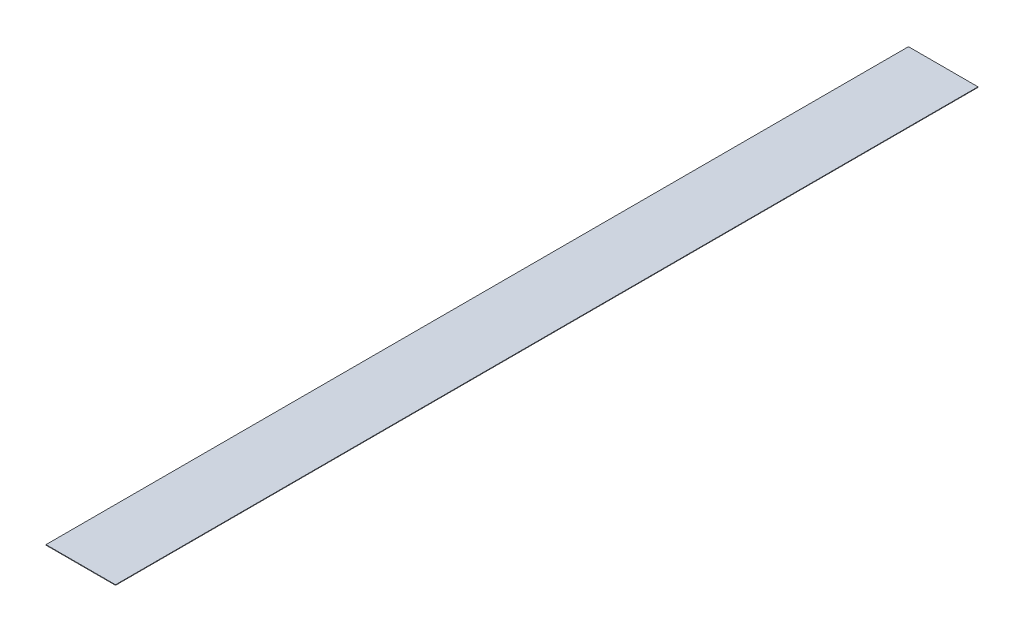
ISO-10303-21;
HEADER;
FILE_DESCRIPTION(('STEP AP214'),'2;1');
FILE_NAME('part.step','',(''),(''),'','','');
FILE_SCHEMA(('AUTOMOTIVE_DESIGN { 1 0 10303 214 1 1 1 1 }'));
ENDSEC;
DATA;
#1=APPLICATION_CONTEXT('core data for automotive mechanical design processes');
#2=APPLICATION_PROTOCOL_DEFINITION('international standard','automotive_design',2000,#1);
#3=PRODUCT_CONTEXT('',#1,'mechanical');
#4=PRODUCT('Part','Part','',(#3));
#5=PRODUCT_RELATED_PRODUCT_CATEGORY('part','',(#4));
#6=PRODUCT_DEFINITION_FORMATION('','',#4);
#7=PRODUCT_DEFINITION_CONTEXT('part definition',#1,'design');
#8=PRODUCT_DEFINITION('design','',#6,#7);
#9=PRODUCT_DEFINITION_SHAPE('','',#8);
#10=(LENGTH_UNIT() NAMED_UNIT(*) SI_UNIT(.MILLI.,.METRE.));
#11=(NAMED_UNIT(*) PLANE_ANGLE_UNIT() SI_UNIT($,.RADIAN.));
#12=(NAMED_UNIT(*) SI_UNIT($,.STERADIAN.) SOLID_ANGLE_UNIT());
#13=UNCERTAINTY_MEASURE_WITH_UNIT(LENGTH_MEASURE(1.E-05),#10,'distance_accuracy_value','');
#14=(GEOMETRIC_REPRESENTATION_CONTEXT(3) GLOBAL_UNCERTAINTY_ASSIGNED_CONTEXT((#13)) GLOBAL_UNIT_ASSIGNED_CONTEXT((#10,
#11,#12)) REPRESENTATION_CONTEXT('',''));
#15=CARTESIAN_POINT('',(0.,0.,0.));
#16=DIRECTION('',(0.,0.,1.));
#17=DIRECTION('',(1.,0.,0.));
#18=AXIS2_PLACEMENT_3D('',#15,#16,#17);
#19=CARTESIAN_POINT('',(-12.0527,0.175,-149.5));
#20=DIRECTION('',(1.,0.,0.));
#21=DIRECTION('',(0.,0.,-1.));
#22=AXIS2_PLACEMENT_3D('',#19,#20,#21);
#23=PLANE('',#22);
#24=DIRECTION('',(0.,0.,1.));
#25=VECTOR('',#24,1.);
#26=CARTESIAN_POINT('',(-12.0527,0.,-149.5));
#27=LINE('',#26,#25);
#28=CARTESIAN_POINT('',(-12.0527,0.,-149.5));
#29=VERTEX_POINT('',#28);
#30=CARTESIAN_POINT('',(-12.0527,0.,149.5));
#31=VERTEX_POINT('',#30);
#32=EDGE_CURVE('E98',#29,#31,#27,.T.);
#33=ORIENTED_EDGE('',*,*,#32,.T.);
#34=DIRECTION('',(0.,-1.,0.));
#35=VECTOR('',#34,1.);
#36=CARTESIAN_POINT('',(-12.0527,0.175,149.5));
#37=LINE('',#36,#35);
#38=CARTESIAN_POINT('',(-12.0527,0.175,149.5));
#39=VERTEX_POINT('',#38);
#40=EDGE_CURVE('E11',#39,#31,#37,.T.);
#41=ORIENTED_EDGE('',*,*,#40,.F.);
#42=DIRECTION('',(0.,0.,1.));
#43=VECTOR('',#42,1.);
#44=CARTESIAN_POINT('',(-12.0527,0.175,-149.5));
#45=LINE('',#44,#43);
#46=CARTESIAN_POINT('',(-12.0527,0.175,-149.5));
#47=VERTEX_POINT('',#46);
#48=EDGE_CURVE('E86',#47,#39,#45,.T.);
#49=ORIENTED_EDGE('',*,*,#48,.F.);
#50=DIRECTION('',(0.,-1.,0.));
#51=VECTOR('',#50,1.);
#52=CARTESIAN_POINT('',(-12.0527,0.175,-149.5));
#53=LINE('',#52,#51);
#54=EDGE_CURVE('E94',#47,#29,#53,.T.);
#55=ORIENTED_EDGE('',*,*,#54,.T.);
#56=EDGE_LOOP('',(#33,#41,#49,#55));
#57=FACE_BOUND('',#56,.T.);
#58=ADVANCED_FACE('F35',(#57),#23,.F.);
#59=CARTESIAN_POINT('',(-12.0527,0.175,149.5));
#60=DIRECTION('',(0.,0.,-1.));
#61=DIRECTION('',(-1.,0.,0.));
#62=AXIS2_PLACEMENT_3D('',#59,#60,#61);
#63=PLANE('',#62);
#64=DIRECTION('',(1.,0.,0.));
#65=VECTOR('',#64,1.);
#66=CARTESIAN_POINT('',(-12.0527,0.,149.5));
#67=LINE('',#66,#65);
#68=CARTESIAN_POINT('',(12.0527,0.,149.5));
#69=VERTEX_POINT('',#68);
#70=EDGE_CURVE('E90',#31,#69,#67,.T.);
#71=ORIENTED_EDGE('',*,*,#70,.T.);
#72=DIRECTION('',(0.,-1.,0.));
#73=VECTOR('',#72,1.);
#74=CARTESIAN_POINT('',(12.0527,0.175,149.5));
#75=LINE('',#74,#73);
#76=CARTESIAN_POINT('',(12.0527,0.175,149.5));
#77=VERTEX_POINT('',#76);
#78=EDGE_CURVE('E43',#77,#69,#75,.T.);
#79=ORIENTED_EDGE('',*,*,#78,.F.);
#80=DIRECTION('',(1.,0.,0.));
#81=VECTOR('',#80,1.);
#82=CARTESIAN_POINT('',(-12.0527,0.175,149.5));
#83=LINE('',#82,#81);
#84=EDGE_CURVE('E81',#39,#77,#83,.T.);
#85=ORIENTED_EDGE('',*,*,#84,.F.);
#86=ORIENTED_EDGE('',*,*,#40,.T.);
#87=EDGE_LOOP('',(#71,#79,#85,#86));
#88=FACE_BOUND('',#87,.T.);
#89=ADVANCED_FACE('F89',(#88),#63,.F.);
#90=CARTESIAN_POINT('',(12.0527,0.175,-149.5));
#91=DIRECTION('',(-1.,0.,0.));
#92=DIRECTION('',(0.,0.,1.));
#93=AXIS2_PLACEMENT_3D('',#90,#91,#92);
#94=PLANE('',#93);
#95=DIRECTION('',(0.,0.,-1.));
#96=VECTOR('',#95,1.);
#97=CARTESIAN_POINT('',(12.0527,0.,-149.5));
#98=LINE('',#97,#96);
#99=CARTESIAN_POINT('',(12.0527,0.,-149.5));
#100=VERTEX_POINT('',#99);
#101=EDGE_CURVE('E68',#69,#100,#98,.T.);
#102=ORIENTED_EDGE('',*,*,#101,.T.);
#103=DIRECTION('',(0.,-1.,0.));
#104=VECTOR('',#103,1.);
#105=CARTESIAN_POINT('',(12.0527,0.175,-149.5));
#106=LINE('',#105,#104);
#107=CARTESIAN_POINT('',(12.0527,0.175,-149.5));
#108=VERTEX_POINT('',#107);
#109=EDGE_CURVE('E91',#108,#100,#106,.T.);
#110=ORIENTED_EDGE('',*,*,#109,.F.);
#111=DIRECTION('',(0.,0.,-1.));
#112=VECTOR('',#111,1.);
#113=CARTESIAN_POINT('',(12.0527,0.175,-149.5));
#114=LINE('',#113,#112);
#115=EDGE_CURVE('E84',#77,#108,#114,.T.);
#116=ORIENTED_EDGE('',*,*,#115,.F.);
#117=ORIENTED_EDGE('',*,*,#78,.T.);
#118=EDGE_LOOP('',(#102,#110,#116,#117));
#119=FACE_BOUND('',#118,.T.);
#120=ADVANCED_FACE('F92',(#119),#94,.F.);
#121=CARTESIAN_POINT('',(-12.0527,0.175,-149.5));
#122=DIRECTION('',(0.,0.,1.));
#123=DIRECTION('',(1.,0.,0.));
#124=AXIS2_PLACEMENT_3D('',#121,#122,#123);
#125=PLANE('',#124);
#126=DIRECTION('',(-1.,0.,0.));
#127=VECTOR('',#126,1.);
#128=CARTESIAN_POINT('',(-12.0527,0.,-149.5));
#129=LINE('',#128,#127);
#130=EDGE_CURVE('E74',#100,#29,#129,.T.);
#131=ORIENTED_EDGE('',*,*,#130,.T.);
#132=ORIENTED_EDGE('',*,*,#54,.F.);
#133=DIRECTION('',(-1.,0.,0.));
#134=VECTOR('',#133,1.);
#135=CARTESIAN_POINT('',(-12.0527,0.175,-149.5));
#136=LINE('',#135,#134);
#137=EDGE_CURVE('E51',#108,#47,#136,.T.);
#138=ORIENTED_EDGE('',*,*,#137,.F.);
#139=ORIENTED_EDGE('',*,*,#109,.T.);
#140=EDGE_LOOP('',(#131,#132,#138,#139));
#141=FACE_BOUND('',#140,.T.);
#142=ADVANCED_FACE('F105',(#141),#125,.F.);
#143=CARTESIAN_POINT('',(-12.0527,0.175,149.5));
#144=DIRECTION('',(0.,1.,0.));
#145=DIRECTION('',(0.,0.,1.));
#146=AXIS2_PLACEMENT_3D('',#143,#144,#145);
#147=PLANE('',#146);
#148=ORIENTED_EDGE('',*,*,#48,.T.);
#149=ORIENTED_EDGE('',*,*,#84,.T.);
#150=ORIENTED_EDGE('',*,*,#115,.T.);
#151=ORIENTED_EDGE('',*,*,#137,.T.);
#152=EDGE_LOOP('',(#148,#149,#150,#151));
#153=FACE_BOUND('',#152,.T.);
#154=ADVANCED_FACE('F82',(#153),#147,.T.);
#155=CARTESIAN_POINT('',(-12.0527,0.,149.5));
#156=DIRECTION('',(0.,1.,0.));
#157=DIRECTION('',(0.,0.,1.));
#158=AXIS2_PLACEMENT_3D('',#155,#156,#157);
#159=PLANE('',#158);
#160=ORIENTED_EDGE('',*,*,#32,.F.);
#161=ORIENTED_EDGE('',*,*,#130,.F.);
#162=ORIENTED_EDGE('',*,*,#101,.F.);
#163=ORIENTED_EDGE('',*,*,#70,.F.);
#164=EDGE_LOOP('',(#160,#161,#162,#163));
#165=FACE_BOUND('',#164,.T.);
#166=ADVANCED_FACE('F108',(#165),#159,.F.);
#167=CLOSED_SHELL('',(#58,#89,#120,#142,#154,#166));
#168=MANIFOLD_SOLID_BREP('B2',#167);
#169=ADVANCED_BREP_SHAPE_REPRESENTATION('',(#18,#168),#14);
#170=SHAPE_DEFINITION_REPRESENTATION(#9,#169);
ENDSEC;
END-ISO-10303-21;
